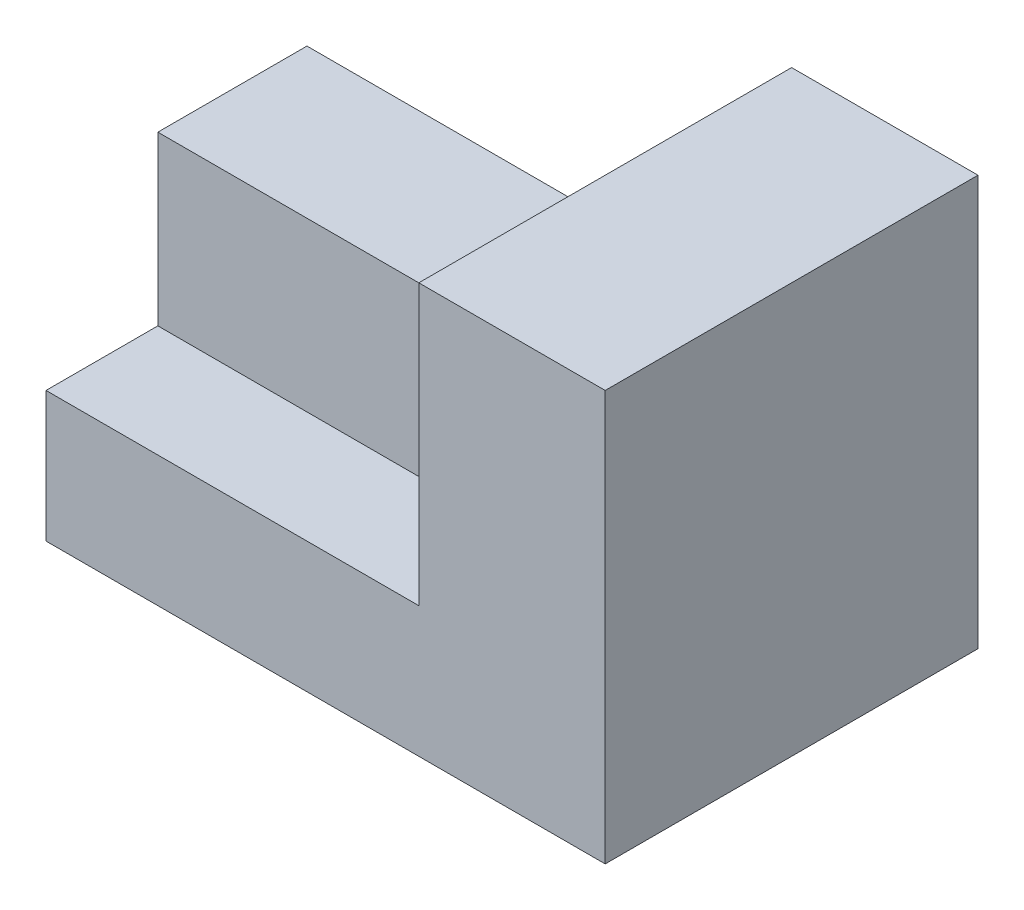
from build123d import *

# Parameters (mm, degrees)
EXTRUDE_1_DEPTH     = 10
SKETCH_2_W          = 21.187739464
SKETCH_2_H          = 8.908045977
CUT_EXTRUDE_1_DEPTH = 9


with BuildPart() as part:
    # Sketch 1 → Extrude 1 (new, symmetric)
    with BuildSketch(Plane.XY):
        Polygon((0, 0), (30, 0), (30, 22), (20, 22), (20, 16), (0, 16), align=None)
    extrude(amount=EXTRUDE_1_DEPTH, both=True)

    # Sketch 2 → Cut-Extrude 1 (cut)
    with BuildSketch(Plane(origin=(0, 16, 0), x_dir=(1, 0, 0), z_dir=(0, 1, 0))):
        with Locations((9.406130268, -8.454022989)):
            Rectangle(SKETCH_2_W, SKETCH_2_H)
    cut_extrude_1 = extrude(amount=-CUT_EXTRUDE_1_DEPTH, mode=Mode.SUBTRACT)

    # Mirror 1: Cut-Extrude 1 across plane
    add(cut_extrude_1.mirror(Plane.XY), mode=Mode.SUBTRACT)


solid = part.part
